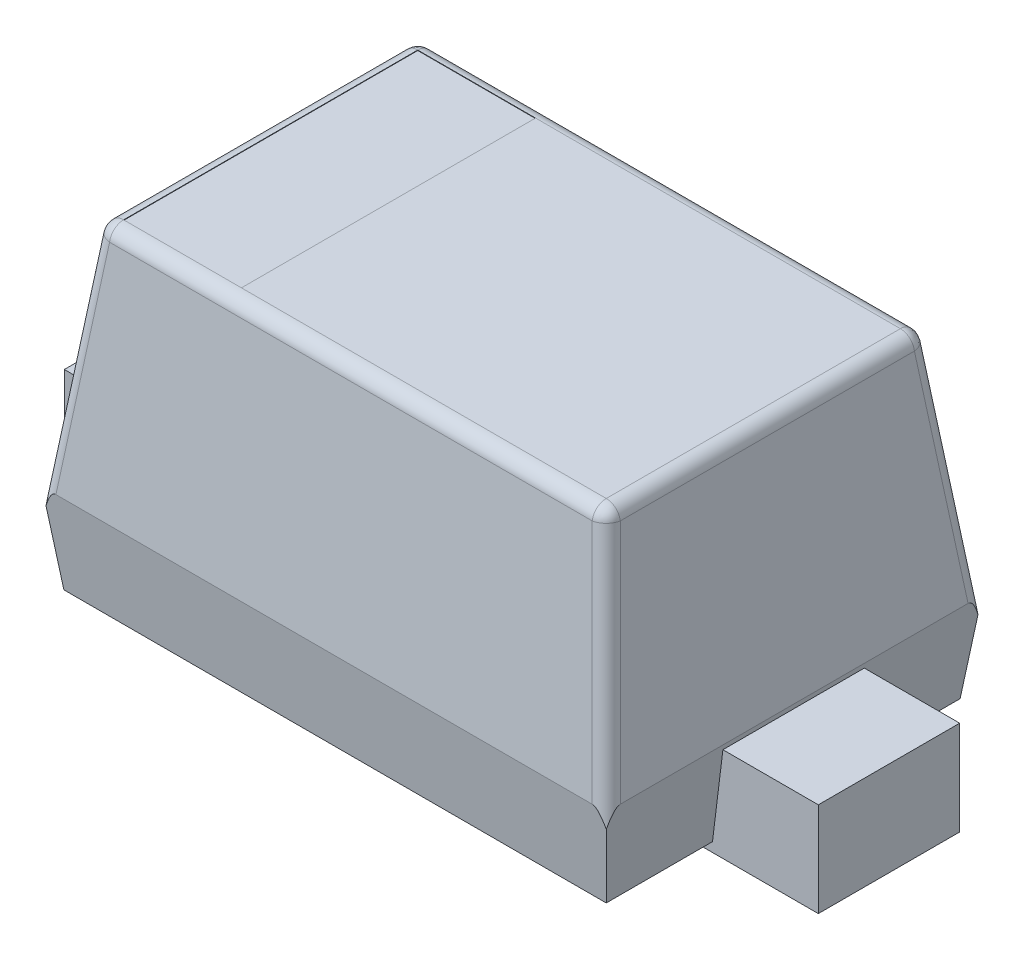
ISO-10303-21;
HEADER;
FILE_DESCRIPTION(('STEP AP214'),'2;1');
FILE_NAME('part.step','',(''),(''),'','','');
FILE_SCHEMA(('AUTOMOTIVE_DESIGN { 1 0 10303 214 1 1 1 1 }'));
ENDSEC;
DATA;
#1=APPLICATION_CONTEXT('core data for automotive mechanical design processes');
#2=APPLICATION_PROTOCOL_DEFINITION('international standard','automotive_design',2000,#1);
#3=PRODUCT_CONTEXT('',#1,'mechanical');
#4=PRODUCT('Part','Part','',(#3));
#5=PRODUCT_RELATED_PRODUCT_CATEGORY('part','',(#4));
#6=PRODUCT_DEFINITION_FORMATION('','',#4);
#7=PRODUCT_DEFINITION_CONTEXT('part definition',#1,'design');
#8=PRODUCT_DEFINITION('design','',#6,#7);
#9=PRODUCT_DEFINITION_SHAPE('','',#8);
#10=(LENGTH_UNIT() NAMED_UNIT(*) SI_UNIT(.MILLI.,.METRE.));
#11=(NAMED_UNIT(*) PLANE_ANGLE_UNIT() SI_UNIT($,.RADIAN.));
#12=(NAMED_UNIT(*) SI_UNIT($,.STERADIAN.) SOLID_ANGLE_UNIT());
#13=UNCERTAINTY_MEASURE_WITH_UNIT(LENGTH_MEASURE(1.E-05),#10,'distance_accuracy_value','');
#14=(GEOMETRIC_REPRESENTATION_CONTEXT(3) GLOBAL_UNCERTAINTY_ASSIGNED_CONTEXT((#13)) GLOBAL_UNIT_ASSIGNED_CONTEXT((#10,
#11,#12)) REPRESENTATION_CONTEXT('',''));
#15=CARTESIAN_POINT('',(0.,0.,0.));
#16=DIRECTION('',(0.,0.,1.));
#17=DIRECTION('',(1.,0.,0.));
#18=AXIS2_PLACEMENT_3D('',#15,#16,#17);
#19=CARTESIAN_POINT('',(-0.512065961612,0.699,-0.312065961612));
#20=DIRECTION('',(0.,1.,0.));
#21=DIRECTION('',(1.,0.,0.));
#22=AXIS2_PLACEMENT_3D('',#19,#20,#21);
#23=PLANE('',#22);
#24=DIRECTION('',(0.,0.,-1.));
#25=VECTOR('',#24,1.);
#26=CARTESIAN_POINT('',(-0.262065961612,0.699,0.312065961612));
#27=LINE('',#26,#25);
#28=CARTESIAN_POINT('',(-0.262065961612,0.699,0.312065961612));
#29=VERTEX_POINT('',#28);
#30=CARTESIAN_POINT('',(-0.262065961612,0.699,-0.312065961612));
#31=VERTEX_POINT('',#30);
#32=EDGE_CURVE('E928',#29,#31,#27,.T.);
#33=ORIENTED_EDGE('',*,*,#32,.T.);
#34=DIRECTION('',(-1.,0.,0.));
#35=VECTOR('',#34,1.);
#36=CARTESIAN_POINT('',(-0.262065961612,0.699,-0.312065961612));
#37=LINE('',#36,#35);
#38=CARTESIAN_POINT('',(-0.512065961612,0.699,-0.312065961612));
#39=VERTEX_POINT('',#38);
#40=EDGE_CURVE('E949',#31,#39,#37,.T.);
#41=ORIENTED_EDGE('',*,*,#40,.T.);
#42=DIRECTION('',(0.,0.,1.));
#43=VECTOR('',#42,1.);
#44=CARTESIAN_POINT('',(-0.512065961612,0.699,0.312065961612));
#45=LINE('',#44,#43);
#46=CARTESIAN_POINT('',(-0.512065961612,0.699,0.312065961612));
#47=VERTEX_POINT('',#46);
#48=EDGE_CURVE('E907',#39,#47,#45,.T.);
#49=ORIENTED_EDGE('',*,*,#48,.T.);
#50=DIRECTION('',(1.,0.,0.));
#51=VECTOR('',#50,1.);
#52=CARTESIAN_POINT('',(-0.262065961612,0.699,0.312065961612));
#53=LINE('',#52,#51);
#54=EDGE_CURVE('E11',#47,#29,#53,.T.);
#55=ORIENTED_EDGE('',*,*,#54,.T.);
#56=EDGE_LOOP('',(#33,#41,#49,#55));
#57=FACE_BOUND('',#56,.T.);
#58=ADVANCED_FACE('F17',(#57),#23,.T.);
#59=CARTESIAN_POINT('',(-0.262065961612,0.699,0.312065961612));
#60=DIRECTION('',(0.,0.,1.));
#61=DIRECTION('',(1.,0.,0.));
#62=AXIS2_PLACEMENT_3D('',#59,#60,#61);
#63=PLANE('',#62);
#64=DIRECTION('',(0.,1.,0.));
#65=VECTOR('',#64,1.);
#66=CARTESIAN_POINT('',(-0.262065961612,0.699,0.312065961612));
#67=LINE('',#66,#65);
#68=CARTESIAN_POINT('',(-0.262065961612,0.7,0.312065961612));
#69=VERTEX_POINT('',#68);
#70=EDGE_CURVE('E28',#29,#69,#67,.T.);
#71=ORIENTED_EDGE('',*,*,#70,.F.);
#72=ORIENTED_EDGE('',*,*,#54,.F.);
#73=DIRECTION('',(0.,-1.,0.));
#74=VECTOR('',#73,1.);
#75=CARTESIAN_POINT('',(-0.512065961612,0.699,0.312065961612));
#76=LINE('',#75,#74);
#77=CARTESIAN_POINT('',(-0.512065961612,0.7,0.312065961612));
#78=VERTEX_POINT('',#77);
#79=EDGE_CURVE('E296',#78,#47,#76,.T.);
#80=ORIENTED_EDGE('',*,*,#79,.F.);
#81=DIRECTION('',(-1.,0.,0.));
#82=VECTOR('',#81,1.);
#83=CARTESIAN_POINT('',(-0.6,0.7,0.312065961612));
#84=LINE('',#83,#82);
#85=EDGE_CURVE('E372',#69,#78,#84,.T.);
#86=ORIENTED_EDGE('',*,*,#85,.F.);
#87=EDGE_LOOP('',(#71,#72,#80,#86));
#88=FACE_BOUND('',#87,.T.);
#89=ADVANCED_FACE('F505',(#88),#63,.F.);
#90=CARTESIAN_POINT('',(-0.262065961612,0.699,0.312065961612));
#91=DIRECTION('',(1.,0.,0.));
#92=DIRECTION('',(0.,1.,0.));
#93=AXIS2_PLACEMENT_3D('',#90,#91,#92);
#94=PLANE('',#93);
#95=DIRECTION('',(0.,-1.,0.));
#96=VECTOR('',#95,1.);
#97=CARTESIAN_POINT('',(-0.262065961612,0.699,-0.312065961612));
#98=LINE('',#97,#96);
#99=CARTESIAN_POINT('',(-0.262065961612,0.7,-0.312065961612));
#100=VERTEX_POINT('',#99);
#101=EDGE_CURVE('E972',#100,#31,#98,.T.);
#102=ORIENTED_EDGE('',*,*,#101,.T.);
#103=ORIENTED_EDGE('',*,*,#32,.F.);
#104=ORIENTED_EDGE('',*,*,#70,.T.);
#105=DIRECTION('',(0.,0.,1.));
#106=VECTOR('',#105,1.);
#107=CARTESIAN_POINT('',(-0.262065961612,0.7,-0.4));
#108=LINE('',#107,#106);
#109=EDGE_CURVE('E1194',#100,#69,#108,.T.);
#110=ORIENTED_EDGE('',*,*,#109,.F.);
#111=EDGE_LOOP('',(#102,#103,#104,#110));
#112=FACE_BOUND('',#111,.T.);
#113=ADVANCED_FACE('F19',(#112),#94,.F.);
#114=CARTESIAN_POINT('',(-0.262065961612,0.699,-0.312065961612));
#115=DIRECTION('',(0.,0.,-1.));
#116=DIRECTION('',(0.,-1.,0.));
#117=AXIS2_PLACEMENT_3D('',#114,#115,#116);
#118=PLANE('',#117);
#119=DIRECTION('',(0.,-1.,0.));
#120=VECTOR('',#119,1.);
#121=CARTESIAN_POINT('',(-0.512065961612,0.699,-0.312065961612));
#122=LINE('',#121,#120);
#123=CARTESIAN_POINT('',(-0.512065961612,0.7,-0.312065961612));
#124=VERTEX_POINT('',#123);
#125=EDGE_CURVE('E944',#124,#39,#122,.T.);
#126=ORIENTED_EDGE('',*,*,#125,.T.);
#127=ORIENTED_EDGE('',*,*,#40,.F.);
#128=ORIENTED_EDGE('',*,*,#101,.F.);
#129=DIRECTION('',(1.,0.,0.));
#130=VECTOR('',#129,1.);
#131=CARTESIAN_POINT('',(-0.6,0.7,-0.312065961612));
#132=LINE('',#131,#130);
#133=EDGE_CURVE('E964',#124,#100,#132,.T.);
#134=ORIENTED_EDGE('',*,*,#133,.F.);
#135=EDGE_LOOP('',(#126,#127,#128,#134));
#136=FACE_BOUND('',#135,.T.);
#137=ADVANCED_FACE('F504',(#136),#118,.F.);
#138=CARTESIAN_POINT('',(-0.512065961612,0.699,0.312065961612));
#139=DIRECTION('',(-1.,0.,0.));
#140=DIRECTION('',(0.,0.,1.));
#141=AXIS2_PLACEMENT_3D('',#138,#139,#140);
#142=PLANE('',#141);
#143=ORIENTED_EDGE('',*,*,#79,.T.);
#144=ORIENTED_EDGE('',*,*,#48,.F.);
#145=ORIENTED_EDGE('',*,*,#125,.F.);
#146=DIRECTION('',(0.,0.,-1.));
#147=VECTOR('',#146,1.);
#148=CARTESIAN_POINT('',(-0.512065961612,0.7,-0.4));
#149=LINE('',#148,#147);
#150=EDGE_CURVE('E297',#78,#124,#149,.T.);
#151=ORIENTED_EDGE('',*,*,#150,.F.);
#152=EDGE_LOOP('',(#143,#144,#145,#151));
#153=FACE_BOUND('',#152,.T.);
#154=ADVANCED_FACE('F513',(#153),#142,.F.);
#155=CARTESIAN_POINT('',(-0.512065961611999,0.673458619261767,-0.341865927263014));
#156=CARTESIAN_POINT('',(-0.512065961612,0.689358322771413,-0.340020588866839));
#157=CARTESIAN_POINT('',(-0.512065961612,0.699999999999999,-0.32806735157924));
#158=CARTESIAN_POINT('',(-0.512065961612,0.7,-0.312065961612));
#159=CARTESIAN_POINT('',(-0.528067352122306,0.673458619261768,-0.341865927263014));
#160=CARTESIAN_POINT('',(-0.528067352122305,0.689358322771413,-0.340020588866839));
#161=CARTESIAN_POINT('',(-0.528067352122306,0.7,-0.32806735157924));
#162=CARTESIAN_POINT('',(-0.528067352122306,0.7,-0.312065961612));
#163=CARTESIAN_POINT('',(-0.540020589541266,0.672231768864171,-0.331295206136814));
#164=CARTESIAN_POINT('',(-0.540020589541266,0.682491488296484,-0.330104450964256));
#165=CARTESIAN_POINT('',(-0.540020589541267,0.689358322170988,-0.322391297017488));
#166=CARTESIAN_POINT('',(-0.540020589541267,0.689358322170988,-0.312065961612));
#167=CARTESIAN_POINT('',(-0.541865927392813,0.670398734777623,-0.315501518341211));
#168=CARTESIAN_POINT('',(-0.541865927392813,0.672231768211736,-0.315288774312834));
#169=CARTESIAN_POINT('',(-0.541865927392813,0.673458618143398,-0.313910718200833));
#170=CARTESIAN_POINT('',(-0.541865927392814,0.673458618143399,-0.312065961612));
#171=(BOUNDED_SURFACE() B_SPLINE_SURFACE(3,3,((#155,#156,#157,#158),(#159,#160,#161,#162),(#163,
#164,#165,#166),(#167,#168,#169,#170)),.UNSPECIFIED.,.F.,.F.,
.F.) B_SPLINE_SURFACE_WITH_KNOTS((4,4),(4,4),(0.,0.998451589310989),(0.00154843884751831,1.),
.UNSPECIFIED.) GEOMETRIC_REPRESENTATION_ITEM() RATIONAL_B_SPLINE_SURFACE(((0.999214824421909,
0.830713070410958,0.830974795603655,1.),(0.830322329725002,0.690301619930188,0.690519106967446,
0.830974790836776),(0.83006081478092,0.690084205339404,0.690301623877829,0.830713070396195),
(0.998430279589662,0.830060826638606,0.830322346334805,0.999214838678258))) REPRESENTATION_ITEM('') SURFACE());
#172=CARTESIAN_POINT('',(-0.512065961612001,0.669999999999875,-0.312065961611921));
#173=DIRECTION('',(-0.120974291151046,-0.985256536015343,-0.120974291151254));
#174=DIRECTION('',(0.,0.121869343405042,-0.992546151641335));
#175=AXIS2_PLACEMENT_3D('',#172,#173,#174);
#176=CIRCLE('',#175,0.03);
#177=CARTESIAN_POINT('',(-0.541842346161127,0.673656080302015,-0.312065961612));
#178=VERTEX_POINT('',#177);
#179=CARTESIAN_POINT('',(-0.512065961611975,0.673656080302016,-0.341842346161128));
#180=VERTEX_POINT('',#179);
#181=EDGE_CURVE('E303',#178,#180,#176,.T.);
#182=CARTESIAN_POINT('',(-0.512065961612,0.67,-0.312065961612));
#183=DIRECTION('',(0.,0.,1.));
#184=DIRECTION('',(1.,0.,0.));
#185=AXIS2_PLACEMENT_3D('',#182,#183,#184);
#186=CIRCLE('',#185,0.03);
#187=EDGE_CURVE('E293',#124,#178,#186,.T.);
#188=CARTESIAN_POINT('',(-0.512065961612,0.67,-0.312065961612));
#189=DIRECTION('',(-1.,0.,0.));
#190=DIRECTION('',(0.,0.,-1.));
#191=AXIS2_PLACEMENT_3D('',#188,#189,#190);
#192=CIRCLE('',#191,0.03);
#193=EDGE_CURVE('E395',#124,#180,#192,.T.);
#194=ORIENTED_EDGE('',*,*,#181,.F.);
#195=ORIENTED_EDGE('',*,*,#187,.F.);
#196=ORIENTED_EDGE('',*,*,#193,.T.);
#197=EDGE_LOOP('',(#194,#195,#196));
#198=FACE_BOUND('',#197,.T.);
#199=ADVANCED_FACE('F518',(#198),#171,.T.);
#200=CARTESIAN_POINT('',(-0.512065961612,0.67,-0.4));
#201=DIRECTION('',(0.,0.,1.));
#202=DIRECTION('',(0.662620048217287,-0.748955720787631,0.));
#203=AXIS2_PLACEMENT_3D('',#200,#201,#202);
#204=CYLINDRICAL_SURFACE('',#203,0.03);
#205=CARTESIAN_POINT('',(-0.512065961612,0.7,0.312065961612));
#206=CARTESIAN_POINT('',(-0.527971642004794,0.7,0.312065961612));
#207=CARTESIAN_POINT('',(-0.539901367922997,0.689464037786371,0.312065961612));
#208=CARTESIAN_POINT('',(-0.541842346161,0.673656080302,0.312065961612));
#209=(BOUNDED_CURVE() B_SPLINE_CURVE(3,(#205,#206,#207,#208),.UNSPECIFIED.,.F.,
.F.) B_SPLINE_CURVE_WITH_KNOTS((4,4),(0.,0.993483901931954),
.UNSPECIFIED.) CURVE() GEOMETRIC_REPRESENTATION_ITEM() RATIONAL_B_SPLINE_CURVE((1.,
0.831815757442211,0.830719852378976,0.996712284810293)) REPRESENTATION_ITEM(''));
#210=CARTESIAN_POINT('',(-0.541842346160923,0.673656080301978,0.31206596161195));
#211=VERTEX_POINT('',#210);
#212=EDGE_CURVE('E379',#78,#211,#209,.T.);
#213=ORIENTED_EDGE('',*,*,#212,.F.);
#214=ORIENTED_EDGE('',*,*,#150,.T.);
#215=ORIENTED_EDGE('',*,*,#187,.T.);
#216=DIRECTION('',(0.,0.,-1.));
#217=VECTOR('',#216,1.);
#218=CARTESIAN_POINT('',(-0.541842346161,0.673656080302,0.4));
#219=LINE('',#218,#217);
#220=EDGE_CURVE('E389',#211,#178,#219,.T.);
#221=ORIENTED_EDGE('',*,*,#220,.F.);
#222=EDGE_LOOP('',(#213,#214,#215,#221));
#223=FACE_BOUND('',#222,.T.);
#224=ADVANCED_FACE('F528',(#223),#204,.T.);
#225=CARTESIAN_POINT('',(-0.512065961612,0.7,0.312065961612));
#226=CARTESIAN_POINT('',(-0.512065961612,0.7,0.328067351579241));
#227=CARTESIAN_POINT('',(-0.512065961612,0.689358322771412,0.34002058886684));
#228=CARTESIAN_POINT('',(-0.512065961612,0.673458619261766,0.341865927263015));
#229=CARTESIAN_POINT('',(-0.528067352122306,0.7,0.312065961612));
#230=CARTESIAN_POINT('',(-0.528067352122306,0.700000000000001,0.328067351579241));
#231=CARTESIAN_POINT('',(-0.528067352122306,0.689358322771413,0.340020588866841));
#232=CARTESIAN_POINT('',(-0.528067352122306,0.673458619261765,0.341865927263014));
#233=CARTESIAN_POINT('',(-0.540020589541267,0.689358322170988,0.312065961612));
#234=CARTESIAN_POINT('',(-0.540020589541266,0.689358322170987,0.322391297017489));
#235=CARTESIAN_POINT('',(-0.540020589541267,0.682491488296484,0.330104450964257));
#236=CARTESIAN_POINT('',(-0.540020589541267,0.67223176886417,0.331295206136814));
#237=CARTESIAN_POINT('',(-0.541865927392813,0.673458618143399,0.312065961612));
#238=CARTESIAN_POINT('',(-0.541865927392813,0.6734586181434,0.313910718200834));
#239=CARTESIAN_POINT('',(-0.541865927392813,0.672231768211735,0.315288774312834));
#240=CARTESIAN_POINT('',(-0.541865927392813,0.670398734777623,0.315501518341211));
#241=(BOUNDED_SURFACE() B_SPLINE_SURFACE(3,3,((#225,#226,#227,#228),(#229,#230,#231,#232),(#233,
#234,#235,#236),(#237,#238,#239,#240)),.UNSPECIFIED.,.F.,.F.,
.F.) B_SPLINE_SURFACE_WITH_KNOTS((4,4),(4,4),(0.,0.998451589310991),(0.,0.998451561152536),
.UNSPECIFIED.) GEOMETRIC_REPRESENTATION_ITEM() RATIONAL_B_SPLINE_SURFACE(((1.,0.830974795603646,
0.830713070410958,0.999214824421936),(0.830974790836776,0.690519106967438,0.690301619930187,
0.830322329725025),(0.830713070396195,0.690301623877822,0.690084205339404,0.830060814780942),
(0.999214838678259,0.830322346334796,0.830060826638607,0.99843027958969))) REPRESENTATION_ITEM('') SURFACE());
#242=CARTESIAN_POINT('',(-0.51206596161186,0.669999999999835,0.312065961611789));
#243=DIRECTION('',(-0.120974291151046,-0.985256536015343,0.120974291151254));
#244=DIRECTION('',(0.,-0.121869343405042,-0.992546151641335));
#245=AXIS2_PLACEMENT_3D('',#242,#243,#244);
#246=CIRCLE('',#245,0.03);
#247=CARTESIAN_POINT('',(-0.512065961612,0.673656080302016,0.341842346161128));
#248=VERTEX_POINT('',#247);
#249=EDGE_CURVE('E309',#248,#211,#246,.T.);
#250=CARTESIAN_POINT('',(-0.512065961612,0.67,0.312065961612));
#251=DIRECTION('',(1.,0.,0.));
#252=DIRECTION('',(0.,0.,-1.));
#253=AXIS2_PLACEMENT_3D('',#250,#251,#252);
#254=CIRCLE('',#253,0.03);
#255=EDGE_CURVE('E369',#78,#248,#254,.T.);
#256=ORIENTED_EDGE('',*,*,#249,.F.);
#257=ORIENTED_EDGE('',*,*,#255,.F.);
#258=ORIENTED_EDGE('',*,*,#212,.T.);
#259=EDGE_LOOP('',(#256,#257,#258));
#260=FACE_BOUND('',#259,.T.);
#261=ADVANCED_FACE('F539',(#260),#241,.T.);
#262=CARTESIAN_POINT('',(0.541865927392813,0.670398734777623,-0.31550151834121));
#263=CARTESIAN_POINT('',(0.541865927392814,0.672231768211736,-0.315288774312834));
#264=CARTESIAN_POINT('',(0.541865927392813,0.673458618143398,-0.313910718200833));
#265=CARTESIAN_POINT('',(0.541865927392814,0.673458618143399,-0.312065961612));
#266=CARTESIAN_POINT('',(0.540020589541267,0.672231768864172,-0.331295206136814));
#267=CARTESIAN_POINT('',(0.540020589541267,0.682491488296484,-0.330104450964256));
#268=CARTESIAN_POINT('',(0.540020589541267,0.689358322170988,-0.322391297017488));
#269=CARTESIAN_POINT('',(0.540020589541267,0.689358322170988,-0.312065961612));
#270=CARTESIAN_POINT('',(0.528067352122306,0.673458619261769,-0.341865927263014));
#271=CARTESIAN_POINT('',(0.528067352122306,0.689358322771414,-0.34002058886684));
#272=CARTESIAN_POINT('',(0.528067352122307,0.7,-0.32806735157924));
#273=CARTESIAN_POINT('',(0.528067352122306,0.700000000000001,-0.312065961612));
#274=CARTESIAN_POINT('',(0.512065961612,0.673458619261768,-0.341865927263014));
#275=CARTESIAN_POINT('',(0.512065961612,0.689358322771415,-0.340020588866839));
#276=CARTESIAN_POINT('',(0.512065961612,0.7,-0.32806735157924));
#277=CARTESIAN_POINT('',(0.512065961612,0.7,-0.312065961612));
#278=(BOUNDED_SURFACE() B_SPLINE_SURFACE(3,3,((#262,#263,#264,#265),(#266,#267,#268,#269),(#270,
#271,#272,#273),(#274,#275,#276,#277)),.UNSPECIFIED.,.F.,.F.,
.F.) B_SPLINE_SURFACE_WITH_KNOTS((4,4),(4,4),(0.00154841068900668,1.),(0.00154843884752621,1.),
.UNSPECIFIED.) GEOMETRIC_REPRESENTATION_ITEM() RATIONAL_B_SPLINE_SURFACE(((0.99843027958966,
0.830060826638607,0.830322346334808,0.99921483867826),(0.830060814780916,0.690084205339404,
0.69030162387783,0.830713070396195),(0.830322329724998,0.690301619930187,0.690519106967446,
0.830974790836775),(0.999214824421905,0.830713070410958,0.830974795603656,1.))) REPRESENTATION_ITEM('') SURFACE());
#279=CARTESIAN_POINT('',(0.512065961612,0.67,-0.312065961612));
#280=DIRECTION('',(1.,0.,0.));
#281=DIRECTION('',(0.,0.,-1.));
#282=AXIS2_PLACEMENT_3D('',#279,#280,#281);
#283=CIRCLE('',#282,0.03);
#284=CARTESIAN_POINT('',(0.512065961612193,0.673656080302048,-0.341842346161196));
#285=VERTEX_POINT('',#284);
#286=CARTESIAN_POINT('',(0.512065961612,0.7,-0.312065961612));
#287=VERTEX_POINT('',#286);
#288=EDGE_CURVE('E366',#285,#287,#283,.T.);
#289=CARTESIAN_POINT('',(0.512065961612,0.7,-0.312065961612));
#290=CARTESIAN_POINT('',(0.527971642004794,0.7,-0.312065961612));
#291=CARTESIAN_POINT('',(0.539901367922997,0.689464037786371,-0.312065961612));
#292=CARTESIAN_POINT('',(0.541842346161,0.673656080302,-0.312065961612));
#293=(BOUNDED_CURVE() B_SPLINE_CURVE(3,(#289,#290,#291,#292),.UNSPECIFIED.,.F.,
.F.) B_SPLINE_CURVE_WITH_KNOTS((4,4),(0.,0.993483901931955),
.UNSPECIFIED.) CURVE() GEOMETRIC_REPRESENTATION_ITEM() RATIONAL_B_SPLINE_CURVE((1.,
0.831815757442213,0.830719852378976,0.996712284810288)) REPRESENTATION_ITEM(''));
#294=CARTESIAN_POINT('',(0.541842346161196,0.673656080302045,-0.312065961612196));
#295=VERTEX_POINT('',#294);
#296=EDGE_CURVE('E301',#287,#295,#293,.T.);
#297=CARTESIAN_POINT('',(0.512065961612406,0.669999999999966,-0.312065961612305));
#298=DIRECTION('',(0.120974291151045,-0.985256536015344,-0.120974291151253));
#299=DIRECTION('',(0.,0.121869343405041,-0.992546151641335));
#300=AXIS2_PLACEMENT_3D('',#297,#298,#299);
#301=CIRCLE('',#300,0.03);
#302=EDGE_CURVE('E321',#285,#295,#301,.T.);
#303=ORIENTED_EDGE('',*,*,#288,.T.);
#304=ORIENTED_EDGE('',*,*,#296,.T.);
#305=ORIENTED_EDGE('',*,*,#302,.F.);
#306=EDGE_LOOP('',(#303,#304,#305));
#307=FACE_BOUND('',#306,.T.);
#308=ADVANCED_FACE('F407',(#307),#278,.T.);
#309=CARTESIAN_POINT('',(0.512065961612,0.67,-0.4));
#310=DIRECTION('',(0.,0.,-1.));
#311=DIRECTION('',(-0.662620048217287,-0.748955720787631,0.));
#312=AXIS2_PLACEMENT_3D('',#309,#310,#311);
#313=CYLINDRICAL_SURFACE('',#312,0.03);
#314=CARTESIAN_POINT('',(0.512065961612,0.67,0.312065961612));
#315=DIRECTION('',(0.,0.,-1.));
#316=DIRECTION('',(-1.,0.,0.));
#317=AXIS2_PLACEMENT_3D('',#314,#315,#316);
#318=CIRCLE('',#317,0.03);
#319=CARTESIAN_POINT('',(0.512065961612,0.7,0.312065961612));
#320=VERTEX_POINT('',#319);
#321=CARTESIAN_POINT('',(0.541842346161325,0.67365608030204,0.312065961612));
#322=VERTEX_POINT('',#321);
#323=EDGE_CURVE('E298',#320,#322,#318,.T.);
#324=ORIENTED_EDGE('',*,*,#323,.T.);
#325=DIRECTION('',(0.,0.,1.));
#326=VECTOR('',#325,1.);
#327=CARTESIAN_POINT('',(0.541842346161,0.673656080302,0.4));
#328=LINE('',#327,#326);
#329=EDGE_CURVE('E351',#295,#322,#328,.T.);
#330=ORIENTED_EDGE('',*,*,#329,.F.);
#331=ORIENTED_EDGE('',*,*,#296,.F.);
#332=DIRECTION('',(0.,0.,1.));
#333=VECTOR('',#332,1.);
#334=CARTESIAN_POINT('',(0.512065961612,0.7,-0.4));
#335=LINE('',#334,#333);
#336=EDGE_CURVE('E359',#287,#320,#335,.T.);
#337=ORIENTED_EDGE('',*,*,#336,.T.);
#338=EDGE_LOOP('',(#324,#330,#331,#337));
#339=FACE_BOUND('',#338,.T.);
#340=ADVANCED_FACE('F411',(#339),#313,.T.);
#341=CARTESIAN_POINT('',(0.541865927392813,0.673458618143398,0.312065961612));
#342=CARTESIAN_POINT('',(0.541865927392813,0.673458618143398,0.313910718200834));
#343=CARTESIAN_POINT('',(0.541865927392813,0.672231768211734,0.315288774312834));
#344=CARTESIAN_POINT('',(0.541865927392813,0.670398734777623,0.31550151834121));
#345=CARTESIAN_POINT('',(0.540020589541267,0.689358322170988,0.312065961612));
#346=CARTESIAN_POINT('',(0.540020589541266,0.689358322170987,0.322391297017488));
#347=CARTESIAN_POINT('',(0.540020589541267,0.682491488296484,0.330104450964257));
#348=CARTESIAN_POINT('',(0.540020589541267,0.67223176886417,0.331295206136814));
#349=CARTESIAN_POINT('',(0.528067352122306,0.699999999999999,0.312065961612));
#350=CARTESIAN_POINT('',(0.528067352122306,0.7,0.328067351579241));
#351=CARTESIAN_POINT('',(0.528067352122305,0.689358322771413,0.34002058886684));
#352=CARTESIAN_POINT('',(0.528067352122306,0.673458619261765,0.341865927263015));
#353=CARTESIAN_POINT('',(0.512065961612,0.7,0.312065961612));
#354=CARTESIAN_POINT('',(0.512065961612,0.7,0.328067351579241));
#355=CARTESIAN_POINT('',(0.512065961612,0.689358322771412,0.34002058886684));
#356=CARTESIAN_POINT('',(0.512065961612,0.673458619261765,0.341865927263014));
#357=(BOUNDED_SURFACE() B_SPLINE_SURFACE(3,3,((#341,#342,#343,#344),(#345,#346,#347,#348),(#349,
#350,#351,#352),(#353,#354,#355,#356)),.UNSPECIFIED.,.F.,.F.,
.F.) B_SPLINE_SURFACE_WITH_KNOTS((4,4),(4,4),(0.00154841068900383,1.),(0.,0.998451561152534),
.UNSPECIFIED.) GEOMETRIC_REPRESENTATION_ITEM() RATIONAL_B_SPLINE_SURFACE(((0.999214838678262,
0.830322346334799,0.830060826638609,0.998430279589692),(0.830713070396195,0.690301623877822,
0.690084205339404,0.830060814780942),(0.830974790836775,0.690519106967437,0.690301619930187,
0.830322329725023),(1.,0.830974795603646,0.830713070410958,0.999214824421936))) REPRESENTATION_ITEM('') SURFACE());
#358=CARTESIAN_POINT('',(0.512065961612,0.67,0.312065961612));
#359=DIRECTION('',(1.,0.,0.));
#360=DIRECTION('',(0.,0.,-1.));
#361=AXIS2_PLACEMENT_3D('',#358,#359,#360);
#362=CIRCLE('',#361,0.03);
#363=CARTESIAN_POINT('',(0.512065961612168,0.673656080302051,0.341842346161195));
#364=VERTEX_POINT('',#363);
#365=EDGE_CURVE('E302',#320,#364,#362,.T.);
#366=CARTESIAN_POINT('',(0.512065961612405,0.669999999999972,0.312065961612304));
#367=DIRECTION('',(0.120974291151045,-0.985256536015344,0.120974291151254));
#368=DIRECTION('',(0.,-0.121869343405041,-0.992546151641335));
#369=AXIS2_PLACEMENT_3D('',#366,#367,#368);
#370=CIRCLE('',#369,0.03);
#371=EDGE_CURVE('E315',#322,#364,#370,.T.);
#372=ORIENTED_EDGE('',*,*,#365,.T.);
#373=ORIENTED_EDGE('',*,*,#371,.F.);
#374=ORIENTED_EDGE('',*,*,#323,.F.);
#375=EDGE_LOOP('',(#372,#373,#374));
#376=FACE_BOUND('',#375,.T.);
#377=ADVANCED_FACE('F415',(#376),#357,.T.);
#378=CARTESIAN_POINT('',(-0.6,0.67,0.312065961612));
#379=DIRECTION('',(1.,0.,0.));
#380=DIRECTION('',(0.,-0.748955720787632,-0.662620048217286));
#381=AXIS2_PLACEMENT_3D('',#378,#379,#380);
#382=CYLINDRICAL_SURFACE('',#381,0.03);
#383=DIRECTION('',(-1.,0.,0.));
#384=VECTOR('',#383,1.);
#385=CARTESIAN_POINT('',(-0.6,0.7,0.312065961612));
#386=LINE('',#385,#384);
#387=EDGE_CURVE('E1199',#320,#69,#386,.T.);
#388=ORIENTED_EDGE('',*,*,#387,.T.);
#389=ORIENTED_EDGE('',*,*,#85,.T.);
#390=ORIENTED_EDGE('',*,*,#255,.T.);
#391=DIRECTION('',(-1.,0.,0.));
#392=VECTOR('',#391,1.);
#393=CARTESIAN_POINT('',(0.6,0.673656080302,0.341842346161));
#394=LINE('',#393,#392);
#395=EDGE_CURVE('E375',#364,#248,#394,.T.);
#396=ORIENTED_EDGE('',*,*,#395,.F.);
#397=ORIENTED_EDGE('',*,*,#365,.F.);
#398=EDGE_LOOP('',(#388,#389,#390,#396,#397));
#399=FACE_BOUND('',#398,.T.);
#400=ADVANCED_FACE('F579',(#399),#382,.T.);
#401=CARTESIAN_POINT('',(-0.6,0.7,-0.4));
#402=DIRECTION('',(0.,1.,0.));
#403=DIRECTION('',(1.,0.,0.));
#404=AXIS2_PLACEMENT_3D('',#401,#402,#403);
#405=PLANE('',#404);
#406=ORIENTED_EDGE('',*,*,#336,.F.);
#407=DIRECTION('',(1.,0.,0.));
#408=VECTOR('',#407,1.);
#409=CARTESIAN_POINT('',(-0.6,0.7,-0.312065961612));
#410=LINE('',#409,#408);
#411=EDGE_CURVE('E1038',#100,#287,#410,.T.);
#412=ORIENTED_EDGE('',*,*,#411,.F.);
#413=ORIENTED_EDGE('',*,*,#109,.T.);
#414=ORIENTED_EDGE('',*,*,#387,.F.);
#415=EDGE_LOOP('',(#406,#412,#413,#414));
#416=FACE_BOUND('',#415,.T.);
#417=ADVANCED_FACE('F586',(#416),#405,.T.);
#418=CARTESIAN_POINT('',(-0.6,0.67,-0.312065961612));
#419=DIRECTION('',(-1.,0.,0.));
#420=DIRECTION('',(0.,-0.748955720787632,0.662620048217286));
#421=AXIS2_PLACEMENT_3D('',#418,#419,#420);
#422=CYLINDRICAL_SURFACE('',#421,0.03);
#423=ORIENTED_EDGE('',*,*,#288,.F.);
#424=DIRECTION('',(1.,0.,0.));
#425=VECTOR('',#424,1.);
#426=CARTESIAN_POINT('',(0.6,0.673656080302,-0.341842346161));
#427=LINE('',#426,#425);
#428=EDGE_CURVE('E362',#180,#285,#427,.T.);
#429=ORIENTED_EDGE('',*,*,#428,.F.);
#430=ORIENTED_EDGE('',*,*,#193,.F.);
#431=ORIENTED_EDGE('',*,*,#133,.T.);
#432=ORIENTED_EDGE('',*,*,#411,.T.);
#433=EDGE_LOOP('',(#423,#429,#430,#431,#432));
#434=FACE_BOUND('',#433,.T.);
#435=ADVANCED_FACE('F591',(#434),#422,.T.);
#436=CARTESIAN_POINT('',(0.6,0.2,-0.4));
#437=DIRECTION('',(0.,0.121869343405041,-0.992546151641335));
#438=DIRECTION('',(-1.,0.,0.));
#439=AXIS2_PLACEMENT_3D('',#436,#437,#438);
#440=PLANE('',#439);
#441=DIRECTION('',(-0.120974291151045,-0.985256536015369,-0.120974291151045));
#442=VECTOR('',#441,1.);
#443=CARTESIAN_POINT('',(-0.512065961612,0.673656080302,-0.341842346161));
#444=LINE('',#443,#442);
#445=CARTESIAN_POINT('',(-0.568995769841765,0.209999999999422,-0.398772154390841));
#446=VERTEX_POINT('',#445);
#447=EDGE_CURVE('E307',#180,#446,#444,.T.);
#448=ORIENTED_EDGE('',*,*,#447,.F.);
#449=ORIENTED_EDGE('',*,*,#428,.T.);
#450=DIRECTION('',(-0.120974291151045,0.985256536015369,0.120974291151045));
#451=VECTOR('',#450,1.);
#452=CARTESIAN_POINT('',(0.570659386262,0.196450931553,-0.400435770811));
#453=LINE('',#452,#451);
#454=CARTESIAN_POINT('',(0.56899576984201,0.210000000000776,-0.398772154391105));
#455=VERTEX_POINT('',#454);
#456=EDGE_CURVE('E234',#455,#285,#453,.T.);
#457=ORIENTED_EDGE('',*,*,#456,.F.);
#458=DIRECTION('',(-1.,0.,0.));
#459=VECTOR('',#458,1.);
#460=CARTESIAN_POINT('',(0.6,0.21,-0.398772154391));
#461=LINE('',#460,#459);
#462=EDGE_CURVE('E231',#455,#446,#461,.T.);
#463=ORIENTED_EDGE('',*,*,#462,.T.);
#464=EDGE_LOOP('',(#448,#449,#457,#463));
#465=FACE_BOUND('',#464,.T.);
#466=ADVANCED_FACE('F602',(#465),#440,.T.);
#467=CARTESIAN_POINT('',(-0.558951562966,0.288147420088,-0.358951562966));
#468=DIRECTION('',(-0.120974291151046,-0.985256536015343,-0.120974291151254));
#469=DIRECTION('',(0.696681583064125,-0.171083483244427,0.69668157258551));
#470=AXIS2_PLACEMENT_3D('',#467,#468,#469);
#471=CYLINDRICAL_SURFACE('',#470,0.03);
#472=DIRECTION('',(-0.120974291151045,-0.985256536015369,-0.120974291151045));
#473=VECTOR('',#472,1.);
#474=CARTESIAN_POINT('',(-0.541842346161,0.673656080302,-0.312065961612));
#475=LINE('',#474,#473);
#476=CARTESIAN_POINT('',(-0.598772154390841,0.209999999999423,-0.368995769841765));
#477=VERTEX_POINT('',#476);
#478=EDGE_CURVE('E308',#178,#477,#475,.T.);
#479=ORIENTED_EDGE('',*,*,#478,.F.);
#480=ORIENTED_EDGE('',*,*,#181,.T.);
#481=ORIENTED_EDGE('',*,*,#447,.T.);
#482=CARTESIAN_POINT('',(-0.583659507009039,0.0869173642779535,-0.383659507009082));
#483=DIRECTION('',(0.,0.121869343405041,0.992546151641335));
#484=DIRECTION('',(-0.12462107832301,-0.984808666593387,0.120919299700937));
#485=AXIS2_PLACEMENT_3D('',#482,#483,#484);
#486=ELLIPSE('',#485,0.124924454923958,0.03);
#487=CARTESIAN_POINT('',(-0.594424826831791,0.174593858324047,-0.394424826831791));
#488=VERTEX_POINT('',#487);
#489=EDGE_CURVE('E262',#446,#488,#486,.T.);
#490=ORIENTED_EDGE('',*,*,#489,.T.);
#491=CARTESIAN_POINT('',(-0.58365950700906,0.0869173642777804,-0.383659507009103));
#492=DIRECTION('',(0.992546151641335,0.121869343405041,0.));
#493=DIRECTION('',(0.120919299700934,-0.984808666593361,-0.124621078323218));
#494=AXIS2_PLACEMENT_3D('',#491,#492,#493);
#495=ELLIPSE('',#494,0.124924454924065,0.03);
#496=EDGE_CURVE('E268',#488,#477,#495,.T.);
#497=ORIENTED_EDGE('',*,*,#496,.T.);
#498=EDGE_LOOP('',(#479,#480,#481,#490,#497));
#499=FACE_BOUND('',#498,.T.);
#500=ADVANCED_FACE('F610',(#499),#471,.T.);
#501=CARTESIAN_POINT('',(-0.6,0.2,0.4));
#502=DIRECTION('',(-0.992546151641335,0.121869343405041,0.));
#503=DIRECTION('',(0.,0.,1.));
#504=AXIS2_PLACEMENT_3D('',#501,#502,#503);
#505=PLANE('',#504);
#506=DIRECTION('',(-0.120974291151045,-0.985256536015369,0.120974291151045));
#507=VECTOR('',#506,1.);
#508=CARTESIAN_POINT('',(-0.582874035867,0.339479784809,0.353097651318));
#509=LINE('',#508,#507);
#510=CARTESIAN_POINT('',(-0.598772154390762,0.209999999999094,0.368995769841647));
#511=VERTEX_POINT('',#510);
#512=EDGE_CURVE('E313',#211,#511,#509,.T.);
#513=ORIENTED_EDGE('',*,*,#512,.F.);
#514=ORIENTED_EDGE('',*,*,#220,.T.);
#515=ORIENTED_EDGE('',*,*,#478,.T.);
#516=DIRECTION('',(0.,0.,1.));
#517=VECTOR('',#516,1.);
#518=CARTESIAN_POINT('',(-0.598772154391,0.21,0.4));
#519=LINE('',#518,#517);
#520=EDGE_CURVE('E269',#477,#511,#519,.T.);
#521=ORIENTED_EDGE('',*,*,#520,.T.);
#522=EDGE_LOOP('',(#513,#514,#515,#521));
#523=FACE_BOUND('',#522,.T.);
#524=ADVANCED_FACE('F615',(#523),#505,.T.);
#525=CARTESIAN_POINT('',(-0.553097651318,0.335823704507,0.353097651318));
#526=DIRECTION('',(-0.120974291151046,-0.985256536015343,0.120974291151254));
#527=DIRECTION('',(0.696681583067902,-0.171083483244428,-0.696681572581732));
#528=AXIS2_PLACEMENT_3D('',#525,#526,#527);
#529=CYLINDRICAL_SURFACE('',#528,0.03);
#530=ORIENTED_EDGE('',*,*,#249,.T.);
#531=ORIENTED_EDGE('',*,*,#512,.T.);
#532=CARTESIAN_POINT('',(-0.583659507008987,0.0869173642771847,0.38365950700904));
#533=DIRECTION('',(0.992546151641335,0.121869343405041,0.));
#534=DIRECTION('',(0.120919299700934,-0.984808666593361,0.124621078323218));
#535=AXIS2_PLACEMENT_3D('',#532,#533,#534);
#536=ELLIPSE('',#535,0.124924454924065,0.03);
#537=CARTESIAN_POINT('',(-0.59442482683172,0.174593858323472,0.39442482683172));
#538=VERTEX_POINT('',#537);
#539=EDGE_CURVE('E273',#511,#538,#536,.T.);
#540=ORIENTED_EDGE('',*,*,#539,.T.);
#541=CARTESIAN_POINT('',(-0.583659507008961,0.0869173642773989,0.383659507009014));
#542=DIRECTION('',(0.,0.121869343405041,-0.992546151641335));
#543=DIRECTION('',(-0.12462107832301,-0.984808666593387,-0.120919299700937));
#544=AXIS2_PLACEMENT_3D('',#541,#542,#543);
#545=ELLIPSE('',#544,0.124924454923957,0.03);
#546=CARTESIAN_POINT('',(-0.568995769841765,0.209999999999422,0.398772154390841));
#547=VERTEX_POINT('',#546);
#548=EDGE_CURVE('E279',#538,#547,#545,.T.);
#549=ORIENTED_EDGE('',*,*,#548,.T.);
#550=DIRECTION('',(-0.120974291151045,-0.985256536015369,0.120974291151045));
#551=VECTOR('',#550,1.);
#552=CARTESIAN_POINT('',(-0.512065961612,0.673656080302,0.341842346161));
#553=LINE('',#552,#551);
#554=EDGE_CURVE('E314',#248,#547,#553,.T.);
#555=ORIENTED_EDGE('',*,*,#554,.F.);
#556=EDGE_LOOP('',(#530,#531,#540,#549,#555));
#557=FACE_BOUND('',#556,.T.);
#558=ADVANCED_FACE('F626',(#557),#529,.T.);
#559=CARTESIAN_POINT('',(0.6,0.2,0.4));
#560=DIRECTION('',(0.,0.121869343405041,0.992546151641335));
#561=DIRECTION('',(1.,0.,0.));
#562=AXIS2_PLACEMENT_3D('',#559,#560,#561);
#563=PLANE('',#562);
#564=DIRECTION('',(0.120974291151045,-0.985256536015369,0.120974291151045));
#565=VECTOR('',#564,1.);
#566=CARTESIAN_POINT('',(0.570659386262,0.196450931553,0.400435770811));
#567=LINE('',#566,#565);
#568=CARTESIAN_POINT('',(0.56899576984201,0.210000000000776,0.398772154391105));
#569=VERTEX_POINT('',#568);
#570=EDGE_CURVE('E319',#364,#569,#567,.T.);
#571=ORIENTED_EDGE('',*,*,#570,.F.);
#572=ORIENTED_EDGE('',*,*,#395,.T.);
#573=ORIENTED_EDGE('',*,*,#554,.T.);
#574=DIRECTION('',(1.,0.,0.));
#575=VECTOR('',#574,1.);
#576=CARTESIAN_POINT('',(0.6,0.21,0.398772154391));
#577=LINE('',#576,#575);
#578=EDGE_CURVE('E280',#547,#569,#577,.T.);
#579=ORIENTED_EDGE('',*,*,#578,.T.);
#580=EDGE_LOOP('',(#571,#572,#573,#579));
#581=FACE_BOUND('',#580,.T.);
#582=ADVANCED_FACE('F420',(#581),#563,.T.);
#583=CARTESIAN_POINT('',(0.570659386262,0.192794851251,0.370659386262));
#584=DIRECTION('',(0.120974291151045,-0.985256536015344,0.120974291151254));
#585=DIRECTION('',(-0.696681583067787,-0.171083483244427,-0.696681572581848));
#586=AXIS2_PLACEMENT_3D('',#583,#584,#585);
#587=CYLINDRICAL_SURFACE('',#586,0.03);
#588=DIRECTION('',(0.120974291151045,-0.985256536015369,0.120974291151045));
#589=VECTOR('',#588,1.);
#590=CARTESIAN_POINT('',(0.541842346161,0.673656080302,0.312065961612));
#591=LINE('',#590,#589);
#592=CARTESIAN_POINT('',(0.598772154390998,0.210000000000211,0.368995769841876));
#593=VERTEX_POINT('',#592);
#594=EDGE_CURVE('E320',#322,#593,#591,.T.);
#595=ORIENTED_EDGE('',*,*,#594,.F.);
#596=ORIENTED_EDGE('',*,*,#371,.T.);
#597=ORIENTED_EDGE('',*,*,#570,.T.);
#598=CARTESIAN_POINT('',(0.583659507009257,0.0869173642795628,0.383659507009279));
#599=DIRECTION('',(0.,0.121869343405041,-0.992546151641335));
#600=DIRECTION('',(0.124621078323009,-0.984808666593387,-0.120919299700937));
#601=AXIS2_PLACEMENT_3D('',#598,#599,#600);
#602=ELLIPSE('',#601,0.124924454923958,0.03);
#603=CARTESIAN_POINT('',(0.594424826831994,0.174593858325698,0.394424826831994));
#604=VERTEX_POINT('',#603);
#605=EDGE_CURVE('E284',#569,#604,#602,.T.);
#606=ORIENTED_EDGE('',*,*,#605,.T.);
#607=CARTESIAN_POINT('',(0.583659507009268,0.0869173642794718,0.383659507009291));
#608=DIRECTION('',(-0.992546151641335,0.121869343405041,0.));
#609=DIRECTION('',(-0.120919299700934,-0.984808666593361,0.124621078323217));
#610=AXIS2_PLACEMENT_3D('',#607,#608,#609);
#611=ELLIPSE('',#610,0.124924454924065,0.03);
#612=EDGE_CURVE('E290',#604,#593,#611,.T.);
#613=ORIENTED_EDGE('',*,*,#612,.T.);
#614=EDGE_LOOP('',(#595,#596,#597,#606,#613));
#615=FACE_BOUND('',#614,.T.);
#616=ADVANCED_FACE('F344',(#615),#587,.T.);
#617=CARTESIAN_POINT('',(0.6,0.2,0.4));
#618=DIRECTION('',(0.992546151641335,0.121869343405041,0.));
#619=DIRECTION('',(0.,0.,-1.));
#620=AXIS2_PLACEMENT_3D('',#617,#618,#619);
#621=PLANE('',#620);
#622=DIRECTION('',(0.120974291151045,-0.985256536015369,-0.120974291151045));
#623=VECTOR('',#622,1.);
#624=CARTESIAN_POINT('',(0.600435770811,0.196450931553,-0.370659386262));
#625=LINE('',#624,#623);
#626=CARTESIAN_POINT('',(0.598772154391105,0.210000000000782,-0.368995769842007));
#627=VERTEX_POINT('',#626);
#628=EDGE_CURVE('E213',#295,#627,#625,.T.);
#629=ORIENTED_EDGE('',*,*,#628,.F.);
#630=ORIENTED_EDGE('',*,*,#329,.T.);
#631=ORIENTED_EDGE('',*,*,#594,.T.);
#632=DIRECTION('',(0.,0.,-1.));
#633=VECTOR('',#632,1.);
#634=CARTESIAN_POINT('',(0.598772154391,0.21,0.4));
#635=LINE('',#634,#633);
#636=EDGE_CURVE('E241',#593,#627,#635,.T.);
#637=ORIENTED_EDGE('',*,*,#636,.T.);
#638=EDGE_LOOP('',(#629,#630,#631,#637));
#639=FACE_BOUND('',#638,.T.);
#640=ADVANCED_FACE('F349',(#639),#621,.T.);
#641=CARTESIAN_POINT('',(0.570659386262,0.192794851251,-0.370659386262));
#642=DIRECTION('',(0.120974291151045,-0.985256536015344,-0.120974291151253));
#643=DIRECTION('',(-0.69668158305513,-0.171083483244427,0.696681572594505));
#644=AXIS2_PLACEMENT_3D('',#641,#642,#643);
#645=CYLINDRICAL_SURFACE('',#644,0.03);
#646=ORIENTED_EDGE('',*,*,#456,.T.);
#647=ORIENTED_EDGE('',*,*,#302,.T.);
#648=ORIENTED_EDGE('',*,*,#628,.T.);
#649=CARTESIAN_POINT('',(0.583659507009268,0.0869173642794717,-0.383659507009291));
#650=DIRECTION('',(-0.992546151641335,0.121869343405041,0.));
#651=DIRECTION('',(-0.120919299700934,-0.984808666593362,-0.124621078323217));
#652=AXIS2_PLACEMENT_3D('',#649,#650,#651);
#653=ELLIPSE('',#652,0.124924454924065,0.03);
#654=CARTESIAN_POINT('',(0.594424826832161,0.174593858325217,-0.394424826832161));
#655=VERTEX_POINT('',#654);
#656=EDGE_CURVE('E21',#627,#655,#653,.T.);
#657=ORIENTED_EDGE('',*,*,#656,.T.);
#658=CARTESIAN_POINT('',(0.583659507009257,0.0869173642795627,-0.383659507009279));
#659=DIRECTION('',(0.,0.121869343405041,0.992546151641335));
#660=DIRECTION('',(0.124621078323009,-0.984808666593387,0.120919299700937));
#661=AXIS2_PLACEMENT_3D('',#658,#659,#660);
#662=ELLIPSE('',#661,0.124924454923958,0.03);
#663=EDGE_CURVE('E222',#655,#455,#662,.T.);
#664=ORIENTED_EDGE('',*,*,#663,.T.);
#665=EDGE_LOOP('',(#646,#647,#648,#657,#664));
#666=FACE_BOUND('',#665,.T.);
#667=ADVANCED_FACE('F237',(#666),#645,.T.);
#668=CARTESIAN_POINT('',(0.6,0.22,-0.4));
#669=DIRECTION('',(0.,0.121869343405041,0.992546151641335));
#670=DIRECTION('',(1.,0.,0.));
#671=AXIS2_PLACEMENT_3D('',#668,#669,#670);
#672=PLANE('',#671);
#673=DIRECTION('',(-1.,0.,0.));
#674=VECTOR('',#673,1.);
#675=CARTESIAN_POINT('',(-0.6,0.02,-0.375443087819));
#676=LINE('',#675,#674);
#677=CARTESIAN_POINT('',(0.575443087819,0.02,-0.375443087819));
#678=VERTEX_POINT('',#677);
#679=CARTESIAN_POINT('',(-0.575443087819,0.02,-0.375443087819));
#680=VERTEX_POINT('',#679);
#681=EDGE_CURVE('E1417',#678,#680,#676,.T.);
#682=ORIENTED_EDGE('',*,*,#681,.T.);
#683=DIRECTION('',(-0.120974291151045,0.985256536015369,-0.120974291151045));
#684=VECTOR('',#683,1.);
#685=CARTESIAN_POINT('',(-0.575443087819,0.02,-0.375443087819));
#686=LINE('',#685,#684);
#687=EDGE_CURVE('E263',#680,#488,#686,.T.);
#688=ORIENTED_EDGE('',*,*,#687,.T.);
#689=ORIENTED_EDGE('',*,*,#489,.F.);
#690=ORIENTED_EDGE('',*,*,#462,.F.);
#691=ORIENTED_EDGE('',*,*,#663,.F.);
#692=DIRECTION('',(-0.120974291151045,-0.985256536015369,0.120974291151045));
#693=VECTOR('',#692,1.);
#694=CARTESIAN_POINT('',(0.594424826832,0.174593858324,-0.394424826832));
#695=LINE('',#694,#693);
#696=EDGE_CURVE('E227',#655,#678,#695,.T.);
#697=ORIENTED_EDGE('',*,*,#696,.T.);
#698=EDGE_LOOP('',(#682,#688,#689,#690,#691,#697));
#699=FACE_BOUND('',#698,.T.);
#700=ADVANCED_FACE('F224',(#699),#672,.F.);
#701=CARTESIAN_POINT('',(-0.8,0.,0.15));
#702=DIRECTION('',(0.,1.,0.));
#703=DIRECTION('',(1.,0.,0.));
#704=AXIS2_PLACEMENT_3D('',#701,#702,#703);
#705=PLANE('',#704);
#706=DIRECTION('',(0.,0.,-1.));
#707=VECTOR('',#706,1.);
#708=CARTESIAN_POINT('',(-0.8,0.,-0.15));
#709=LINE('',#708,#707);
#710=CARTESIAN_POINT('',(-0.8,0.,0.15));
#711=VERTEX_POINT('',#710);
#712=CARTESIAN_POINT('',(-0.8,0.,-0.15));
#713=VERTEX_POINT('',#712);
#714=EDGE_CURVE('E326',#711,#713,#709,.T.);
#715=ORIENTED_EDGE('',*,*,#714,.T.);
#716=DIRECTION('',(1.,0.,0.));
#717=VECTOR('',#716,1.);
#718=CARTESIAN_POINT('',(-0.55,0.,-0.15));
#719=LINE('',#718,#717);
#720=CARTESIAN_POINT('',(-0.55,0.,-0.15));
#721=VERTEX_POINT('',#720);
#722=EDGE_CURVE('E1065',#713,#721,#719,.T.);
#723=ORIENTED_EDGE('',*,*,#722,.T.);
#724=DIRECTION('',(0.,0.,1.));
#725=VECTOR('',#724,1.);
#726=CARTESIAN_POINT('',(-0.55,0.,0.15));
#727=LINE('',#726,#725);
#728=CARTESIAN_POINT('',(-0.55,0.,0.15));
#729=VERTEX_POINT('',#728);
#730=EDGE_CURVE('E1076',#721,#729,#727,.T.);
#731=ORIENTED_EDGE('',*,*,#730,.T.);
#732=DIRECTION('',(-1.,0.,0.));
#733=VECTOR('',#732,1.);
#734=CARTESIAN_POINT('',(-0.55,0.,0.15));
#735=LINE('',#734,#733);
#736=EDGE_CURVE('E1077',#729,#711,#735,.T.);
#737=ORIENTED_EDGE('',*,*,#736,.T.);
#738=EDGE_LOOP('',(#715,#723,#731,#737));
#739=FACE_BOUND('',#738,.T.);
#740=ADVANCED_FACE('F729',(#739),#705,.F.);
#741=CARTESIAN_POINT('',(-0.8,0.2,-0.15));
#742=DIRECTION('',(1.,0.,0.));
#743=DIRECTION('',(0.,1.,0.));
#744=AXIS2_PLACEMENT_3D('',#741,#742,#743);
#745=PLANE('',#744);
#746=DIRECTION('',(0.,1.,0.));
#747=VECTOR('',#746,1.);
#748=CARTESIAN_POINT('',(-0.8,0.2,0.15));
#749=LINE('',#748,#747);
#750=CARTESIAN_POINT('',(-0.8,0.2,0.15));
#751=VERTEX_POINT('',#750);
#752=EDGE_CURVE('E1095',#711,#751,#749,.T.);
#753=ORIENTED_EDGE('',*,*,#752,.T.);
#754=DIRECTION('',(0.,0.,1.));
#755=VECTOR('',#754,1.);
#756=CARTESIAN_POINT('',(-0.8,0.2,0.15));
#757=LINE('',#756,#755);
#758=CARTESIAN_POINT('',(-0.8,0.2,-0.15));
#759=VERTEX_POINT('',#758);
#760=EDGE_CURVE('E1108',#759,#751,#757,.T.);
#761=ORIENTED_EDGE('',*,*,#760,.F.);
#762=DIRECTION('',(0.,-1.,0.));
#763=VECTOR('',#762,1.);
#764=CARTESIAN_POINT('',(-0.8,0.2,-0.15));
#765=LINE('',#764,#763);
#766=EDGE_CURVE('E1060',#759,#713,#765,.T.);
#767=ORIENTED_EDGE('',*,*,#766,.T.);
#768=ORIENTED_EDGE('',*,*,#714,.F.);
#769=EDGE_LOOP('',(#753,#761,#767,#768));
#770=FACE_BOUND('',#769,.T.);
#771=ADVANCED_FACE('F695',(#770),#745,.F.);
#772=CARTESIAN_POINT('',(-0.55,0.2,-0.15));
#773=DIRECTION('',(0.,0.,1.));
#774=DIRECTION('',(1.,0.,0.));
#775=AXIS2_PLACEMENT_3D('',#772,#773,#774);
#776=PLANE('',#775);
#777=DIRECTION('',(1.,0.,0.));
#778=VECTOR('',#777,1.);
#779=CARTESIAN_POINT('',(-0.6,0.02,-0.15));
#780=LINE('',#779,#778);
#781=CARTESIAN_POINT('',(-0.575443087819,0.02,-0.15));
#782=VERTEX_POINT('',#781);
#783=CARTESIAN_POINT('',(-0.55,0.02,-0.15));
#784=VERTEX_POINT('',#783);
#785=EDGE_CURVE('E1439',#782,#784,#780,.T.);
#786=ORIENTED_EDGE('',*,*,#785,.T.);
#787=DIRECTION('',(0.,-1.,0.));
#788=VECTOR('',#787,1.);
#789=CARTESIAN_POINT('',(-0.55,0.2,-0.15));
#790=LINE('',#789,#788);
#791=EDGE_CURVE('E1086',#784,#721,#790,.T.);
#792=ORIENTED_EDGE('',*,*,#791,.T.);
#793=ORIENTED_EDGE('',*,*,#722,.F.);
#794=ORIENTED_EDGE('',*,*,#766,.F.);
#795=DIRECTION('',(-1.,0.,0.));
#796=VECTOR('',#795,1.);
#797=CARTESIAN_POINT('',(-0.55,0.2,-0.15));
#798=LINE('',#797,#796);
#799=CARTESIAN_POINT('',(-0.597544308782,0.2,-0.15));
#800=VERTEX_POINT('',#799);
#801=EDGE_CURVE('E1114',#800,#759,#798,.T.);
#802=ORIENTED_EDGE('',*,*,#801,.F.);
#803=DIRECTION('',(0.121869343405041,-0.992546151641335,0.));
#804=VECTOR('',#803,1.);
#805=CARTESIAN_POINT('',(-0.6,0.22,-0.15));
#806=LINE('',#805,#804);
#807=EDGE_CURVE('E267',#800,#782,#806,.T.);
#808=ORIENTED_EDGE('',*,*,#807,.T.);
#809=EDGE_LOOP('',(#786,#792,#793,#794,#802,#808));
#810=FACE_BOUND('',#809,.T.);
#811=ADVANCED_FACE('F689',(#810),#776,.F.);
#812=CARTESIAN_POINT('',(-0.55,0.2,0.15));
#813=DIRECTION('',(-1.,0.,0.));
#814=DIRECTION('',(0.,0.,1.));
#815=AXIS2_PLACEMENT_3D('',#812,#813,#814);
#816=PLANE('',#815);
#817=DIRECTION('',(0.,0.,1.));
#818=VECTOR('',#817,1.);
#819=CARTESIAN_POINT('',(-0.55,0.02,-0.4));
#820=LINE('',#819,#818);
#821=CARTESIAN_POINT('',(-0.55,0.02,0.15));
#822=VERTEX_POINT('',#821);
#823=EDGE_CURVE('E1454',#784,#822,#820,.T.);
#824=ORIENTED_EDGE('',*,*,#823,.T.);
#825=DIRECTION('',(0.,-1.,0.));
#826=VECTOR('',#825,1.);
#827=CARTESIAN_POINT('',(-0.55,0.2,0.15));
#828=LINE('',#827,#826);
#829=EDGE_CURVE('E1071',#822,#729,#828,.T.);
#830=ORIENTED_EDGE('',*,*,#829,.T.);
#831=ORIENTED_EDGE('',*,*,#730,.F.);
#832=ORIENTED_EDGE('',*,*,#791,.F.);
#833=EDGE_LOOP('',(#824,#830,#831,#832));
#834=FACE_BOUND('',#833,.T.);
#835=ADVANCED_FACE('F694',(#834),#816,.F.);
#836=CARTESIAN_POINT('',(-0.55,0.2,0.15));
#837=DIRECTION('',(0.,0.,-1.));
#838=DIRECTION('',(-1.,0.,0.));
#839=AXIS2_PLACEMENT_3D('',#836,#837,#838);
#840=PLANE('',#839);
#841=DIRECTION('',(-1.,0.,0.));
#842=VECTOR('',#841,1.);
#843=CARTESIAN_POINT('',(-0.6,0.02,0.15));
#844=LINE('',#843,#842);
#845=CARTESIAN_POINT('',(-0.575443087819,0.02,0.15));
#846=VERTEX_POINT('',#845);
#847=EDGE_CURVE('E1465',#822,#846,#844,.T.);
#848=ORIENTED_EDGE('',*,*,#847,.T.);
#849=DIRECTION('',(-0.121869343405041,0.992546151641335,0.));
#850=VECTOR('',#849,1.);
#851=CARTESIAN_POINT('',(-0.6,0.22,0.15));
#852=LINE('',#851,#850);
#853=CARTESIAN_POINT('',(-0.597544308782,0.2,0.15));
#854=VERTEX_POINT('',#853);
#855=EDGE_CURVE('E278',#846,#854,#852,.T.);
#856=ORIENTED_EDGE('',*,*,#855,.T.);
#857=DIRECTION('',(1.,0.,0.));
#858=VECTOR('',#857,1.);
#859=CARTESIAN_POINT('',(-0.55,0.2,0.15));
#860=LINE('',#859,#858);
#861=EDGE_CURVE('E1113',#751,#854,#860,.T.);
#862=ORIENTED_EDGE('',*,*,#861,.F.);
#863=ORIENTED_EDGE('',*,*,#752,.F.);
#864=ORIENTED_EDGE('',*,*,#736,.F.);
#865=ORIENTED_EDGE('',*,*,#829,.F.);
#866=EDGE_LOOP('',(#848,#856,#862,#863,#864,#865));
#867=FACE_BOUND('',#866,.T.);
#868=ADVANCED_FACE('F707',(#867),#840,.F.);
#869=CARTESIAN_POINT('',(-0.8,0.2,0.15));
#870=DIRECTION('',(0.,1.,0.));
#871=DIRECTION('',(1.,0.,0.));
#872=AXIS2_PLACEMENT_3D('',#869,#870,#871);
#873=PLANE('',#872);
#874=ORIENTED_EDGE('',*,*,#801,.T.);
#875=ORIENTED_EDGE('',*,*,#760,.T.);
#876=ORIENTED_EDGE('',*,*,#861,.T.);
#877=DIRECTION('',(0.,0.,-1.));
#878=VECTOR('',#877,1.);
#879=CARTESIAN_POINT('',(-0.597544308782,0.2,0.4));
#880=LINE('',#879,#878);
#881=EDGE_CURVE('E1124',#854,#800,#880,.T.);
#882=ORIENTED_EDGE('',*,*,#881,.T.);
#883=EDGE_LOOP('',(#874,#875,#876,#882));
#884=FACE_BOUND('',#883,.T.);
#885=ADVANCED_FACE('F718',(#884),#873,.T.);
#886=CARTESIAN_POINT('',(-0.6,0.22,0.4));
#887=DIRECTION('',(0.992546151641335,0.121869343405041,0.));
#888=DIRECTION('',(0.,0.,-1.));
#889=AXIS2_PLACEMENT_3D('',#886,#887,#888);
#890=PLANE('',#889);
#891=ORIENTED_EDGE('',*,*,#855,.F.);
#892=DIRECTION('',(0.,0.,1.));
#893=VECTOR('',#892,1.);
#894=CARTESIAN_POINT('',(-0.575443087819,0.02,-0.4));
#895=LINE('',#894,#893);
#896=CARTESIAN_POINT('',(-0.575443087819,0.02,0.375443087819));
#897=VERTEX_POINT('',#896);
#898=EDGE_CURVE('E1470',#846,#897,#895,.T.);
#899=ORIENTED_EDGE('',*,*,#898,.T.);
#900=DIRECTION('',(-0.120974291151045,0.985256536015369,0.120974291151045));
#901=VECTOR('',#900,1.);
#902=CARTESIAN_POINT('',(-0.575443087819,0.02,0.375443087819));
#903=LINE('',#902,#901);
#904=EDGE_CURVE('E274',#897,#538,#903,.T.);
#905=ORIENTED_EDGE('',*,*,#904,.T.);
#906=ORIENTED_EDGE('',*,*,#539,.F.);
#907=ORIENTED_EDGE('',*,*,#520,.F.);
#908=ORIENTED_EDGE('',*,*,#496,.F.);
#909=ORIENTED_EDGE('',*,*,#687,.F.);
#910=DIRECTION('',(0.,0.,1.));
#911=VECTOR('',#910,1.);
#912=CARTESIAN_POINT('',(-0.575443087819,0.02,-0.4));
#913=LINE('',#912,#911);
#914=EDGE_CURVE('E1425',#680,#782,#913,.T.);
#915=ORIENTED_EDGE('',*,*,#914,.T.);
#916=ORIENTED_EDGE('',*,*,#807,.F.);
#917=ORIENTED_EDGE('',*,*,#881,.F.);
#918=EDGE_LOOP('',(#891,#899,#905,#906,#907,#908,#909,#915,#916,#917));
#919=FACE_BOUND('',#918,.T.);
#920=ADVANCED_FACE('F771',(#919),#890,.F.);
#921=CARTESIAN_POINT('',(0.6,0.22,0.4));
#922=DIRECTION('',(0.,0.121869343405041,-0.992546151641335));
#923=DIRECTION('',(-1.,0.,0.));
#924=AXIS2_PLACEMENT_3D('',#921,#922,#923);
#925=PLANE('',#924);
#926=DIRECTION('',(1.,0.,0.));
#927=VECTOR('',#926,1.);
#928=CARTESIAN_POINT('',(-0.6,0.02,0.375443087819));
#929=LINE('',#928,#927);
#930=CARTESIAN_POINT('',(0.575443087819,0.02,0.375443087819));
#931=VERTEX_POINT('',#930);
#932=EDGE_CURVE('E429',#897,#931,#929,.T.);
#933=ORIENTED_EDGE('',*,*,#932,.T.);
#934=DIRECTION('',(0.120974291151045,0.985256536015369,0.120974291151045));
#935=VECTOR('',#934,1.);
#936=CARTESIAN_POINT('',(0.575443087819,0.02,0.375443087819));
#937=LINE('',#936,#935);
#938=EDGE_CURVE('E285',#931,#604,#937,.T.);
#939=ORIENTED_EDGE('',*,*,#938,.T.);
#940=ORIENTED_EDGE('',*,*,#605,.F.);
#941=ORIENTED_EDGE('',*,*,#578,.F.);
#942=ORIENTED_EDGE('',*,*,#548,.F.);
#943=ORIENTED_EDGE('',*,*,#904,.F.);
#944=EDGE_LOOP('',(#933,#939,#940,#941,#942,#943));
#945=FACE_BOUND('',#944,.T.);
#946=ADVANCED_FACE('F425',(#945),#925,.F.);
#947=CARTESIAN_POINT('',(0.8,0.,0.15));
#948=DIRECTION('',(0.,-1.,0.));
#949=DIRECTION('',(0.,0.,-1.));
#950=AXIS2_PLACEMENT_3D('',#947,#948,#949);
#951=PLANE('',#950);
#952=DIRECTION('',(0.,0.,-1.));
#953=VECTOR('',#952,1.);
#954=CARTESIAN_POINT('',(0.55,0.,0.15));
#955=LINE('',#954,#953);
#956=CARTESIAN_POINT('',(0.55,0.,0.15));
#957=VERTEX_POINT('',#956);
#958=CARTESIAN_POINT('',(0.55,0.,-0.15));
#959=VERTEX_POINT('',#958);
#960=EDGE_CURVE('E1356',#957,#959,#955,.T.);
#961=ORIENTED_EDGE('',*,*,#960,.T.);
#962=DIRECTION('',(1.,0.,0.));
#963=VECTOR('',#962,1.);
#964=CARTESIAN_POINT('',(0.8,0.,-0.15));
#965=LINE('',#964,#963);
#966=CARTESIAN_POINT('',(0.8,0.,-0.15));
#967=VERTEX_POINT('',#966);
#968=EDGE_CURVE('E1369',#959,#967,#965,.T.);
#969=ORIENTED_EDGE('',*,*,#968,.T.);
#970=DIRECTION('',(0.,0.,1.));
#971=VECTOR('',#970,1.);
#972=CARTESIAN_POINT('',(0.8,0.,-0.15));
#973=LINE('',#972,#971);
#974=CARTESIAN_POINT('',(0.8,0.,0.15));
#975=VERTEX_POINT('',#974);
#976=EDGE_CURVE('E336',#967,#975,#973,.T.);
#977=ORIENTED_EDGE('',*,*,#976,.T.);
#978=DIRECTION('',(-1.,0.,0.));
#979=VECTOR('',#978,1.);
#980=CARTESIAN_POINT('',(0.8,0.,0.15));
#981=LINE('',#980,#979);
#982=EDGE_CURVE('E1331',#975,#957,#981,.T.);
#983=ORIENTED_EDGE('',*,*,#982,.T.);
#984=EDGE_LOOP('',(#961,#969,#977,#983));
#985=FACE_BOUND('',#984,.T.);
#986=ADVANCED_FACE('F754',(#985),#951,.T.);
#987=CARTESIAN_POINT('',(0.8,0.2,-0.15));
#988=DIRECTION('',(-1.,0.,0.));
#989=DIRECTION('',(0.,0.,1.));
#990=AXIS2_PLACEMENT_3D('',#987,#988,#989);
#991=PLANE('',#990);
#992=DIRECTION('',(0.,1.,0.));
#993=VECTOR('',#992,1.);
#994=CARTESIAN_POINT('',(0.8,0.2,-0.15));
#995=LINE('',#994,#993);
#996=CARTESIAN_POINT('',(0.8,0.2,-0.15));
#997=VERTEX_POINT('',#996);
#998=EDGE_CURVE('E1375',#967,#997,#995,.T.);
#999=ORIENTED_EDGE('',*,*,#998,.T.);
#1000=DIRECTION('',(0.,0.,1.));
#1001=VECTOR('',#1000,1.);
#1002=CARTESIAN_POINT('',(0.8,0.2,0.15));
#1003=LINE('',#1002,#1001);
#1004=CARTESIAN_POINT('',(0.8,0.2,0.15));
#1005=VERTEX_POINT('',#1004);
#1006=EDGE_CURVE('E1231',#997,#1005,#1003,.T.);
#1007=ORIENTED_EDGE('',*,*,#1006,.T.);
#1008=DIRECTION('',(0.,-1.,0.));
#1009=VECTOR('',#1008,1.);
#1010=CARTESIAN_POINT('',(0.8,0.2,0.15));
#1011=LINE('',#1010,#1009);
#1012=EDGE_CURVE('E1322',#1005,#975,#1011,.T.);
#1013=ORIENTED_EDGE('',*,*,#1012,.T.);
#1014=ORIENTED_EDGE('',*,*,#976,.F.);
#1015=EDGE_LOOP('',(#999,#1007,#1013,#1014));
#1016=FACE_BOUND('',#1015,.T.);
#1017=ADVANCED_FACE('F759',(#1016),#991,.F.);
#1018=CARTESIAN_POINT('',(0.8,0.2,0.15));
#1019=DIRECTION('',(0.,-1.,0.));
#1020=DIRECTION('',(0.,0.,-1.));
#1021=AXIS2_PLACEMENT_3D('',#1018,#1019,#1020);
#1022=PLANE('',#1021);
#1023=DIRECTION('',(1.,0.,0.));
#1024=VECTOR('',#1023,1.);
#1025=CARTESIAN_POINT('',(0.8,0.2,0.15));
#1026=LINE('',#1025,#1024);
#1027=CARTESIAN_POINT('',(0.597544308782,0.2,0.15));
#1028=VERTEX_POINT('',#1027);
#1029=EDGE_CURVE('E255',#1028,#1005,#1026,.T.);
#1030=ORIENTED_EDGE('',*,*,#1029,.T.);
#1031=ORIENTED_EDGE('',*,*,#1006,.F.);
#1032=DIRECTION('',(-1.,0.,0.));
#1033=VECTOR('',#1032,1.);
#1034=CARTESIAN_POINT('',(0.8,0.2,-0.15));
#1035=LINE('',#1034,#1033);
#1036=CARTESIAN_POINT('',(0.597544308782,0.2,-0.15));
#1037=VERTEX_POINT('',#1036);
#1038=EDGE_CURVE('E1380',#997,#1037,#1035,.T.);
#1039=ORIENTED_EDGE('',*,*,#1038,.T.);
#1040=DIRECTION('',(0.,0.,1.));
#1041=VECTOR('',#1040,1.);
#1042=CARTESIAN_POINT('',(0.597544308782,0.2,0.4));
#1043=LINE('',#1042,#1041);
#1044=EDGE_CURVE('E289',#1037,#1028,#1043,.T.);
#1045=ORIENTED_EDGE('',*,*,#1044,.T.);
#1046=EDGE_LOOP('',(#1030,#1031,#1039,#1045));
#1047=FACE_BOUND('',#1046,.T.);
#1048=ADVANCED_FACE('F781',(#1047),#1022,.F.);
#1049=CARTESIAN_POINT('',(0.6,0.22,0.4));
#1050=DIRECTION('',(-0.992546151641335,0.121869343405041,0.));
#1051=DIRECTION('',(0.,0.,1.));
#1052=AXIS2_PLACEMENT_3D('',#1049,#1050,#1051);
#1053=PLANE('',#1052);
#1054=DIRECTION('',(-0.121869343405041,-0.992546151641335,0.));
#1055=VECTOR('',#1054,1.);
#1056=CARTESIAN_POINT('',(0.597544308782,0.2,-0.15));
#1057=LINE('',#1056,#1055);
#1058=CARTESIAN_POINT('',(0.575443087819,0.02,-0.15));
#1059=VERTEX_POINT('',#1058);
#1060=EDGE_CURVE('E1394',#1037,#1059,#1057,.T.);
#1061=ORIENTED_EDGE('',*,*,#1060,.T.);
#1062=DIRECTION('',(0.,0.,-1.));
#1063=VECTOR('',#1062,1.);
#1064=CARTESIAN_POINT('',(0.575443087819,0.02,-0.4));
#1065=LINE('',#1064,#1063);
#1066=EDGE_CURVE('E245',#1059,#678,#1065,.T.);
#1067=ORIENTED_EDGE('',*,*,#1066,.T.);
#1068=ORIENTED_EDGE('',*,*,#696,.F.);
#1069=ORIENTED_EDGE('',*,*,#656,.F.);
#1070=ORIENTED_EDGE('',*,*,#636,.F.);
#1071=ORIENTED_EDGE('',*,*,#612,.F.);
#1072=ORIENTED_EDGE('',*,*,#938,.F.);
#1073=DIRECTION('',(0.,0.,-1.));
#1074=VECTOR('',#1073,1.);
#1075=CARTESIAN_POINT('',(0.575443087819,0.02,-0.4));
#1076=LINE('',#1075,#1074);
#1077=CARTESIAN_POINT('',(0.575443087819,0.02,0.15));
#1078=VERTEX_POINT('',#1077);
#1079=EDGE_CURVE('E433',#931,#1078,#1076,.T.);
#1080=ORIENTED_EDGE('',*,*,#1079,.T.);
#1081=DIRECTION('',(0.121869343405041,0.992546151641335,0.));
#1082=VECTOR('',#1081,1.);
#1083=CARTESIAN_POINT('',(0.575443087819,0.02,0.15));
#1084=LINE('',#1083,#1082);
#1085=EDGE_CURVE('E248',#1078,#1028,#1084,.T.);
#1086=ORIENTED_EDGE('',*,*,#1085,.T.);
#1087=ORIENTED_EDGE('',*,*,#1044,.F.);
#1088=EDGE_LOOP('',(#1061,#1067,#1068,#1069,#1070,#1071,#1072,#1080,#1086,#1087));
#1089=FACE_BOUND('',#1088,.T.);
#1090=ADVANCED_FACE('F243',(#1089),#1053,.F.);
#1091=CARTESIAN_POINT('',(0.8,0.2,0.15));
#1092=DIRECTION('',(0.,0.,-1.));
#1093=DIRECTION('',(0.,-1.,0.));
#1094=AXIS2_PLACEMENT_3D('',#1091,#1092,#1093);
#1095=PLANE('',#1094);
#1096=DIRECTION('',(-1.,0.,0.));
#1097=VECTOR('',#1096,1.);
#1098=CARTESIAN_POINT('',(-0.6,0.02,0.15));
#1099=LINE('',#1098,#1097);
#1100=CARTESIAN_POINT('',(0.55,0.02,0.15));
#1101=VERTEX_POINT('',#1100);
#1102=EDGE_CURVE('E1501',#1078,#1101,#1099,.T.);
#1103=ORIENTED_EDGE('',*,*,#1102,.T.);
#1104=DIRECTION('',(0.,-1.,0.));
#1105=VECTOR('',#1104,1.);
#1106=CARTESIAN_POINT('',(0.55,0.2,0.15));
#1107=LINE('',#1106,#1105);
#1108=EDGE_CURVE('E1350',#1101,#957,#1107,.T.);
#1109=ORIENTED_EDGE('',*,*,#1108,.T.);
#1110=ORIENTED_EDGE('',*,*,#982,.F.);
#1111=ORIENTED_EDGE('',*,*,#1012,.F.);
#1112=ORIENTED_EDGE('',*,*,#1029,.F.);
#1113=ORIENTED_EDGE('',*,*,#1085,.F.);
#1114=EDGE_LOOP('',(#1103,#1109,#1110,#1111,#1112,#1113));
#1115=FACE_BOUND('',#1114,.T.);
#1116=ADVANCED_FACE('F802',(#1115),#1095,.F.);
#1117=CARTESIAN_POINT('',(0.55,0.2,0.15));
#1118=DIRECTION('',(1.,0.,0.));
#1119=DIRECTION('',(0.,1.,0.));
#1120=AXIS2_PLACEMENT_3D('',#1117,#1118,#1119);
#1121=PLANE('',#1120);
#1122=DIRECTION('',(0.,0.,-1.));
#1123=VECTOR('',#1122,1.);
#1124=CARTESIAN_POINT('',(0.55,0.02,-0.4));
#1125=LINE('',#1124,#1123);
#1126=CARTESIAN_POINT('',(0.55,0.02,-0.15));
#1127=VERTEX_POINT('',#1126);
#1128=EDGE_CURVE('E1510',#1101,#1127,#1125,.T.);
#1129=ORIENTED_EDGE('',*,*,#1128,.T.);
#1130=DIRECTION('',(0.,-1.,0.));
#1131=VECTOR('',#1130,1.);
#1132=CARTESIAN_POINT('',(0.55,0.2,-0.15));
#1133=LINE('',#1132,#1131);
#1134=EDGE_CURVE('E1360',#1127,#959,#1133,.T.);
#1135=ORIENTED_EDGE('',*,*,#1134,.T.);
#1136=ORIENTED_EDGE('',*,*,#960,.F.);
#1137=ORIENTED_EDGE('',*,*,#1108,.F.);
#1138=EDGE_LOOP('',(#1129,#1135,#1136,#1137));
#1139=FACE_BOUND('',#1138,.T.);
#1140=ADVANCED_FACE('F812',(#1139),#1121,.F.);
#1141=CARTESIAN_POINT('',(0.8,0.2,-0.15));
#1142=DIRECTION('',(0.,0.,1.));
#1143=DIRECTION('',(1.,0.,0.));
#1144=AXIS2_PLACEMENT_3D('',#1141,#1142,#1143);
#1145=PLANE('',#1144);
#1146=DIRECTION('',(1.,0.,0.));
#1147=VECTOR('',#1146,1.);
#1148=CARTESIAN_POINT('',(-0.6,0.02,-0.15));
#1149=LINE('',#1148,#1147);
#1150=EDGE_CURVE('E1405',#1127,#1059,#1149,.T.);
#1151=ORIENTED_EDGE('',*,*,#1150,.T.);
#1152=ORIENTED_EDGE('',*,*,#1060,.F.);
#1153=ORIENTED_EDGE('',*,*,#1038,.F.);
#1154=ORIENTED_EDGE('',*,*,#998,.F.);
#1155=ORIENTED_EDGE('',*,*,#968,.F.);
#1156=ORIENTED_EDGE('',*,*,#1134,.F.);
#1157=EDGE_LOOP('',(#1151,#1152,#1153,#1154,#1155,#1156));
#1158=FACE_BOUND('',#1157,.T.);
#1159=ADVANCED_FACE('F832',(#1158),#1145,.F.);
#1160=CARTESIAN_POINT('',(-0.6,0.02,-0.4));
#1161=DIRECTION('',(0.,1.,0.));
#1162=DIRECTION('',(1.,0.,0.));
#1163=AXIS2_PLACEMENT_3D('',#1160,#1161,#1162);
#1164=PLANE('',#1163);
#1165=ORIENTED_EDGE('',*,*,#1128,.F.);
#1166=ORIENTED_EDGE('',*,*,#1102,.F.);
#1167=ORIENTED_EDGE('',*,*,#1079,.F.);
#1168=ORIENTED_EDGE('',*,*,#932,.F.);
#1169=ORIENTED_EDGE('',*,*,#898,.F.);
#1170=ORIENTED_EDGE('',*,*,#847,.F.);
#1171=ORIENTED_EDGE('',*,*,#823,.F.);
#1172=ORIENTED_EDGE('',*,*,#785,.F.);
#1173=ORIENTED_EDGE('',*,*,#914,.F.);
#1174=ORIENTED_EDGE('',*,*,#681,.F.);
#1175=ORIENTED_EDGE('',*,*,#1066,.F.);
#1176=ORIENTED_EDGE('',*,*,#1150,.F.);
#1177=EDGE_LOOP('',(#1165,#1166,#1167,#1168,#1169,#1170,#1171,#1172,#1173,#1174,#1175,#1176));
#1178=FACE_BOUND('',#1177,.T.);
#1179=ADVANCED_FACE('F851',(#1178),#1164,.F.);
#1180=CLOSED_SHELL('',(#58,#89,#113,#137,#154,#199,#224,#261,#308,#340,#377,#400,#417,#435,#466,
#500,#524,#558,#582,#616,#640,#667,#700,#740,#771,#811,#835,#868,#885,#920,#946,#986,#1017,
#1048,#1090,#1116,#1140,#1159,#1179));
#1181=MANIFOLD_SOLID_BREP('B1',#1180);
#1182=ADVANCED_BREP_SHAPE_REPRESENTATION('',(#18,#1181),#14);
#1183=SHAPE_DEFINITION_REPRESENTATION(#9,#1182);
ENDSEC;
END-ISO-10303-21;
